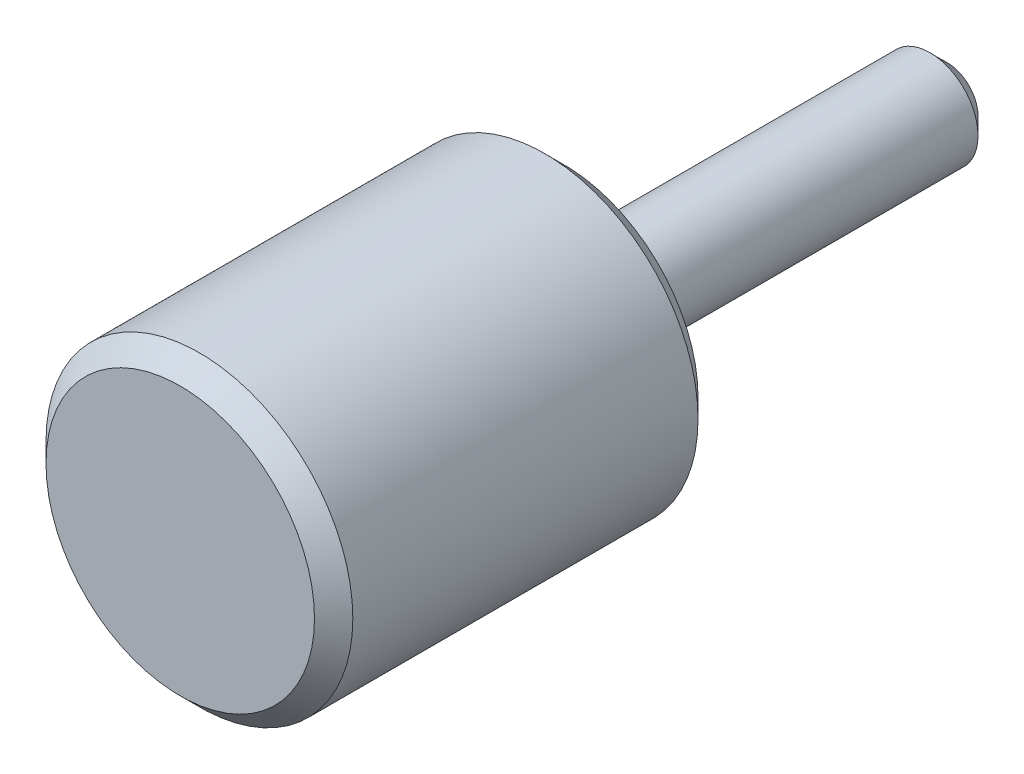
ISO-10303-21;
HEADER;
FILE_DESCRIPTION(('STEP AP214'),'2;1');
FILE_NAME('part.step','',(''),(''),'','','');
FILE_SCHEMA(('AUTOMOTIVE_DESIGN { 1 0 10303 214 1 1 1 1 }'));
ENDSEC;
DATA;
#1=APPLICATION_CONTEXT('core data for automotive mechanical design processes');
#2=APPLICATION_PROTOCOL_DEFINITION('international standard','automotive_design',2000,#1);
#3=PRODUCT_CONTEXT('',#1,'mechanical');
#4=PRODUCT('Part','Part','',(#3));
#5=PRODUCT_RELATED_PRODUCT_CATEGORY('part','',(#4));
#6=PRODUCT_DEFINITION_FORMATION('','',#4);
#7=PRODUCT_DEFINITION_CONTEXT('part definition',#1,'design');
#8=PRODUCT_DEFINITION('design','',#6,#7);
#9=PRODUCT_DEFINITION_SHAPE('','',#8);
#10=(LENGTH_UNIT() NAMED_UNIT(*) SI_UNIT(.MILLI.,.METRE.));
#11=(NAMED_UNIT(*) PLANE_ANGLE_UNIT() SI_UNIT($,.RADIAN.));
#12=(NAMED_UNIT(*) SI_UNIT($,.STERADIAN.) SOLID_ANGLE_UNIT());
#13=UNCERTAINTY_MEASURE_WITH_UNIT(LENGTH_MEASURE(1.E-05),#10,'distance_accuracy_value','');
#14=(GEOMETRIC_REPRESENTATION_CONTEXT(3) GLOBAL_UNCERTAINTY_ASSIGNED_CONTEXT((#13)) GLOBAL_UNIT_ASSIGNED_CONTEXT((#10,
#11,#12)) REPRESENTATION_CONTEXT('',''));
#15=CARTESIAN_POINT('',(0.,0.,0.));
#16=DIRECTION('',(0.,0.,1.));
#17=DIRECTION('',(1.,0.,0.));
#18=AXIS2_PLACEMENT_3D('',#15,#16,#17);
#19=CARTESIAN_POINT('',(0.,0.,20.));
#20=DIRECTION('',(0.,0.,-1.));
#21=DIRECTION('',(-1.,0.,0.));
#22=AXIS2_PLACEMENT_3D('',#19,#20,#21);
#23=CYLINDRICAL_SURFACE('',#22,8.);
#24=CARTESIAN_POINT('',(0.,0.,19.));
#25=DIRECTION('',(0.,0.,1.));
#26=DIRECTION('',(1.,0.,0.));
#27=AXIS2_PLACEMENT_3D('',#24,#25,#26);
#28=CIRCLE('',#27,8.);
#29=CARTESIAN_POINT('',(8.,0.,19.));
#30=VERTEX_POINT('',#29);
#31=EDGE_CURVE('E24',#30,#30,#28,.F.);
#32=ORIENTED_EDGE('',*,*,#31,.T.);
#33=EDGE_LOOP('',(#32));
#34=FACE_BOUND('',#33,.T.);
#35=CARTESIAN_POINT('',(0.,0.,1.));
#36=DIRECTION('',(0.,0.,1.));
#37=DIRECTION('',(1.,0.,0.));
#38=AXIS2_PLACEMENT_3D('',#35,#36,#37);
#39=CIRCLE('',#38,8.);
#40=CARTESIAN_POINT('',(8.,0.,1.));
#41=VERTEX_POINT('',#40);
#42=EDGE_CURVE('E35',#41,#41,#39,.T.);
#43=ORIENTED_EDGE('',*,*,#42,.T.);
#44=EDGE_LOOP('',(#43));
#45=FACE_BOUND('',#44,.T.);
#46=ADVANCED_FACE('F12',(#34,#45),#23,.T.);
#47=CARTESIAN_POINT('',(0.,0.,20.));
#48=DIRECTION('',(0.,0.,1.));
#49=DIRECTION('',(1.,0.,0.));
#50=AXIS2_PLACEMENT_3D('',#47,#48,#49);
#51=PLANE('',#50);
#52=CARTESIAN_POINT('',(0.,0.,20.));
#53=DIRECTION('',(0.,0.,1.));
#54=DIRECTION('',(1.,0.,0.));
#55=AXIS2_PLACEMENT_3D('',#52,#53,#54);
#56=CIRCLE('',#55,7.);
#57=CARTESIAN_POINT('',(7.,0.,20.));
#58=VERTEX_POINT('',#57);
#59=EDGE_CURVE('E29',#58,#58,#56,.T.);
#60=ORIENTED_EDGE('',*,*,#59,.T.);
#61=EDGE_LOOP('',(#60));
#62=FACE_BOUND('',#61,.T.);
#63=ADVANCED_FACE('F47',(#62),#51,.T.);
#64=CARTESIAN_POINT('',(0.,0.,0.));
#65=DIRECTION('',(0.,0.,1.));
#66=DIRECTION('',(1.,0.,0.));
#67=AXIS2_PLACEMENT_3D('',#64,#65,#66);
#68=PLANE('',#67);
#69=CARTESIAN_POINT('',(0.,0.,0.));
#70=DIRECTION('',(0.,0.,1.));
#71=DIRECTION('',(1.,0.,0.));
#72=AXIS2_PLACEMENT_3D('',#69,#70,#71);
#73=CIRCLE('',#72,7.);
#74=CARTESIAN_POINT('',(7.,0.,0.));
#75=VERTEX_POINT('',#74);
#76=EDGE_CURVE('E32',#75,#75,#73,.F.);
#77=ORIENTED_EDGE('',*,*,#76,.T.);
#78=EDGE_LOOP('',(#77));
#79=FACE_BOUND('',#78,.T.);
#80=CARTESIAN_POINT('',(0.,0.,0.));
#81=DIRECTION('',(0.,0.,-1.));
#82=DIRECTION('',(-1.,0.,0.));
#83=AXIS2_PLACEMENT_3D('',#80,#81,#82);
#84=CIRCLE('',#83,2.5);
#85=CARTESIAN_POINT('',(-2.5,0.,0.));
#86=VERTEX_POINT('',#85);
#87=EDGE_CURVE('E16',#86,#86,#84,.T.);
#88=ORIENTED_EDGE('',*,*,#87,.F.);
#89=EDGE_LOOP('',(#88));
#90=FACE_BOUND('',#89,.T.);
#91=ADVANCED_FACE('F44',(#79,#90),#68,.F.);
#92=CARTESIAN_POINT('',(0.,0.,1.));
#93=DIRECTION('',(0.,0.,1.));
#94=DIRECTION('',(1.,0.,0.));
#95=AXIS2_PLACEMENT_3D('',#92,#93,#94);
#96=CONICAL_SURFACE('',#95,8.,0.78539816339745);
#97=ORIENTED_EDGE('',*,*,#76,.F.);
#98=EDGE_LOOP('',(#97));
#99=FACE_BOUND('',#98,.T.);
#100=ORIENTED_EDGE('',*,*,#42,.F.);
#101=EDGE_LOOP('',(#100));
#102=FACE_BOUND('',#101,.T.);
#103=ADVANCED_FACE('F46',(#99,#102),#96,.T.);
#104=CARTESIAN_POINT('',(0.,0.,20.));
#105=DIRECTION('',(0.,0.,-1.));
#106=DIRECTION('',(-1.,0.,0.));
#107=AXIS2_PLACEMENT_3D('',#104,#105,#106);
#108=CONICAL_SURFACE('',#107,7.,0.785398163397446);
#109=ORIENTED_EDGE('',*,*,#31,.F.);
#110=EDGE_LOOP('',(#109));
#111=FACE_BOUND('',#110,.T.);
#112=ORIENTED_EDGE('',*,*,#59,.F.);
#113=EDGE_LOOP('',(#112));
#114=FACE_BOUND('',#113,.T.);
#115=ADVANCED_FACE('F55',(#111,#114),#108,.T.);
#116=CARTESIAN_POINT('',(0.,0.,-20.));
#117=DIRECTION('',(0.,0.,1.));
#118=DIRECTION('',(1.,0.,0.));
#119=AXIS2_PLACEMENT_3D('',#116,#117,#118);
#120=PLANE('',#119);
#121=CARTESIAN_POINT('',(0.,0.,-20.));
#122=DIRECTION('',(0.,0.,1.));
#123=DIRECTION('',(1.,0.,0.));
#124=AXIS2_PLACEMENT_3D('',#121,#122,#123);
#125=CIRCLE('',#124,1.6);
#126=CARTESIAN_POINT('',(1.6,0.,-20.));
#127=VERTEX_POINT('',#126);
#128=EDGE_CURVE('E8',#127,#127,#125,.F.);
#129=ORIENTED_EDGE('',*,*,#128,.T.);
#130=EDGE_LOOP('',(#129));
#131=FACE_BOUND('',#130,.T.);
#132=ADVANCED_FACE('F68',(#131),#120,.F.);
#133=CARTESIAN_POINT('',(0.,0.,-19.1));
#134=DIRECTION('',(0.,0.,1.));
#135=DIRECTION('',(1.,0.,0.));
#136=AXIS2_PLACEMENT_3D('',#133,#134,#135);
#137=CONICAL_SURFACE('',#136,2.5,0.785398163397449);
#138=ORIENTED_EDGE('',*,*,#128,.F.);
#139=EDGE_LOOP('',(#138));
#140=FACE_BOUND('',#139,.T.);
#141=CARTESIAN_POINT('',(0.,0.,-19.1));
#142=DIRECTION('',(0.,0.,1.));
#143=DIRECTION('',(1.,0.,0.));
#144=AXIS2_PLACEMENT_3D('',#141,#142,#143);
#145=CIRCLE('',#144,2.5);
#146=CARTESIAN_POINT('',(2.5,0.,-19.1));
#147=VERTEX_POINT('',#146);
#148=EDGE_CURVE('E20',#147,#147,#145,.T.);
#149=ORIENTED_EDGE('',*,*,#148,.F.);
#150=EDGE_LOOP('',(#149));
#151=FACE_BOUND('',#150,.T.);
#152=ADVANCED_FACE('F66',(#140,#151),#137,.T.);
#153=CARTESIAN_POINT('',(0.,0.,10.));
#154=DIRECTION('',(0.,0.,-1.));
#155=DIRECTION('',(-1.,0.,0.));
#156=AXIS2_PLACEMENT_3D('',#153,#154,#155);
#157=CYLINDRICAL_SURFACE('',#156,2.5);
#158=ORIENTED_EDGE('',*,*,#87,.T.);
#159=EDGE_LOOP('',(#158));
#160=FACE_BOUND('',#159,.T.);
#161=ORIENTED_EDGE('',*,*,#148,.T.);
#162=EDGE_LOOP('',(#161));
#163=FACE_BOUND('',#162,.T.);
#164=ADVANCED_FACE('F14',(#160,#163),#157,.T.);
#165=CLOSED_SHELL('',(#46,#63,#91,#103,#115,#132,#152,#164));
#166=MANIFOLD_SOLID_BREP('B1',#165);
#167=ADVANCED_BREP_SHAPE_REPRESENTATION('',(#18,#166),#14);
#168=SHAPE_DEFINITION_REPRESENTATION(#9,#167);
ENDSEC;
END-ISO-10303-21;
